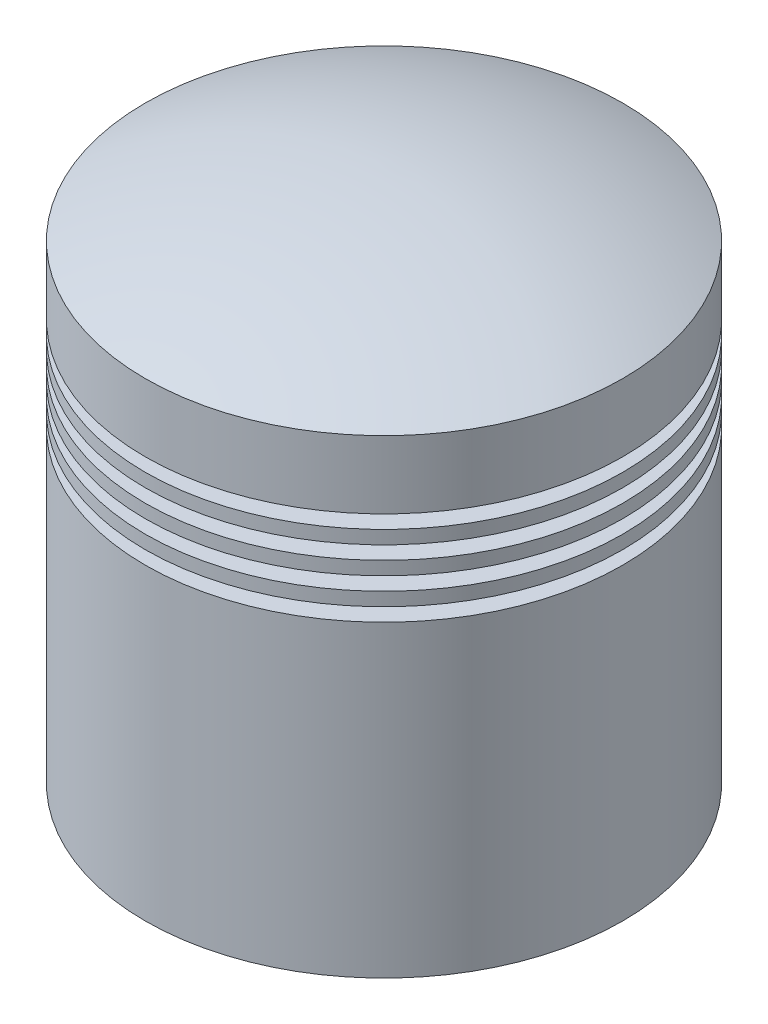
ISO-10303-21;
HEADER;
FILE_DESCRIPTION(('STEP AP214'),'2;1');
FILE_NAME('part.step','',(''),(''),'','','');
FILE_SCHEMA(('AUTOMOTIVE_DESIGN { 1 0 10303 214 1 1 1 1 }'));
ENDSEC;
DATA;
#1=APPLICATION_CONTEXT('core data for automotive mechanical design processes');
#2=APPLICATION_PROTOCOL_DEFINITION('international standard','automotive_design',2000,#1);
#3=PRODUCT_CONTEXT('',#1,'mechanical');
#4=PRODUCT('Part','Part','',(#3));
#5=PRODUCT_RELATED_PRODUCT_CATEGORY('part','',(#4));
#6=PRODUCT_DEFINITION_FORMATION('','',#4);
#7=PRODUCT_DEFINITION_CONTEXT('part definition',#1,'design');
#8=PRODUCT_DEFINITION('design','',#6,#7);
#9=PRODUCT_DEFINITION_SHAPE('','',#8);
#10=(LENGTH_UNIT() NAMED_UNIT(*) SI_UNIT(.MILLI.,.METRE.));
#11=(NAMED_UNIT(*) PLANE_ANGLE_UNIT() SI_UNIT($,.RADIAN.));
#12=(NAMED_UNIT(*) SI_UNIT($,.STERADIAN.) SOLID_ANGLE_UNIT());
#13=UNCERTAINTY_MEASURE_WITH_UNIT(LENGTH_MEASURE(1.E-05),#10,'distance_accuracy_value','');
#14=(GEOMETRIC_REPRESENTATION_CONTEXT(3) GLOBAL_UNCERTAINTY_ASSIGNED_CONTEXT((#13)) GLOBAL_UNIT_ASSIGNED_CONTEXT((#10,
#11,#12)) REPRESENTATION_CONTEXT('',''));
#15=CARTESIAN_POINT('',(0.,0.,0.));
#16=DIRECTION('',(0.,0.,1.));
#17=DIRECTION('',(1.,0.,0.));
#18=AXIS2_PLACEMENT_3D('',#15,#16,#17);
#19=CARTESIAN_POINT('',(44.5392513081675,72.2640545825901,0.));
#20=DIRECTION('',(0.,-1.,0.));
#21=DIRECTION('',(0.,0.,-1.));
#22=AXIS2_PLACEMENT_3D('',#19,#20,#21);
#23=PLANE('',#22);
#24=CARTESIAN_POINT('',(0.,72.2640545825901,0.));
#25=DIRECTION('',(0.,-1.,0.));
#26=DIRECTION('',(0.,0.,-1.));
#27=AXIS2_PLACEMENT_3D('',#24,#25,#26);
#28=CIRCLE('',#27,44.5392513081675);
#29=CARTESIAN_POINT('',(0.,72.2640545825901,-44.5392513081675));
#30=VERTEX_POINT('',#29);
#31=EDGE_CURVE('E10',#30,#30,#28,.T.);
#32=ORIENTED_EDGE('',*,*,#31,.T.);
#33=EDGE_LOOP('',(#32));
#34=FACE_BOUND('',#33,.T.);
#35=CARTESIAN_POINT('',(0.,72.2640545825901,0.));
#36=DIRECTION('',(0.,-1.,0.));
#37=DIRECTION('',(0.,0.,-1.));
#38=AXIS2_PLACEMENT_3D('',#35,#36,#37);
#39=CIRCLE('',#38,39.5392513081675);
#40=CARTESIAN_POINT('',(0.,72.2640545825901,-39.5392513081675));
#41=VERTEX_POINT('',#40);
#42=EDGE_CURVE('E100',#41,#41,#39,.T.);
#43=ORIENTED_EDGE('',*,*,#42,.F.);
#44=EDGE_LOOP('',(#43));
#45=FACE_BOUND('',#44,.T.);
#46=ADVANCED_FACE('F30',(#34,#45),#23,.T.);
#47=CARTESIAN_POINT('',(0.,0.,0.));
#48=DIRECTION('',(0.,-1.,0.));
#49=DIRECTION('',(0.,0.,-1.));
#50=AXIS2_PLACEMENT_3D('',#47,#48,#49);
#51=CYLINDRICAL_SURFACE('',#50,44.5392513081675);
#52=CARTESIAN_POINT('',(0.,74.7640545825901,0.));
#53=DIRECTION('',(0.,-1.,0.));
#54=DIRECTION('',(0.,0.,-1.));
#55=AXIS2_PLACEMENT_3D('',#52,#53,#54);
#56=CIRCLE('',#55,44.5392513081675);
#57=CARTESIAN_POINT('',(0.,74.7640545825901,-44.5392513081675));
#58=VERTEX_POINT('',#57);
#59=EDGE_CURVE('E36',#58,#58,#56,.T.);
#60=ORIENTED_EDGE('',*,*,#59,.T.);
#61=EDGE_LOOP('',(#60));
#62=FACE_BOUND('',#61,.T.);
#63=ORIENTED_EDGE('',*,*,#31,.F.);
#64=EDGE_LOOP('',(#63));
#65=FACE_BOUND('',#64,.T.);
#66=ADVANCED_FACE('F108',(#62,#65),#51,.T.);
#67=CARTESIAN_POINT('',(44.5392513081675,74.7640545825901,0.));
#68=DIRECTION('',(0.,1.,0.));
#69=DIRECTION('',(0.,0.,1.));
#70=AXIS2_PLACEMENT_3D('',#67,#68,#69);
#71=PLANE('',#70);
#72=CARTESIAN_POINT('',(0.,74.7640545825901,0.));
#73=DIRECTION('',(0.,-1.,0.));
#74=DIRECTION('',(0.,0.,-1.));
#75=AXIS2_PLACEMENT_3D('',#72,#73,#74);
#76=CIRCLE('',#75,39.5392513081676);
#77=CARTESIAN_POINT('',(0.,74.7640545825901,-39.5392513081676));
#78=VERTEX_POINT('',#77);
#79=EDGE_CURVE('E40',#78,#78,#76,.T.);
#80=ORIENTED_EDGE('',*,*,#79,.T.);
#81=EDGE_LOOP('',(#80));
#82=FACE_BOUND('',#81,.T.);
#83=ORIENTED_EDGE('',*,*,#59,.F.);
#84=EDGE_LOOP('',(#83));
#85=FACE_BOUND('',#84,.T.);
#86=ADVANCED_FACE('F112',(#82,#85),#71,.T.);
#87=CARTESIAN_POINT('',(0.,0.,0.));
#88=DIRECTION('',(0.,-1.,0.));
#89=DIRECTION('',(0.,0.,-1.));
#90=AXIS2_PLACEMENT_3D('',#87,#88,#89);
#91=CYLINDRICAL_SURFACE('',#90,39.5392513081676);
#92=CARTESIAN_POINT('',(0.,77.2640545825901,0.));
#93=DIRECTION('',(0.,-1.,0.));
#94=DIRECTION('',(0.,0.,-1.));
#95=AXIS2_PLACEMENT_3D('',#92,#93,#94);
#96=CIRCLE('',#95,39.5392513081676);
#97=CARTESIAN_POINT('',(0.,77.2640545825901,-39.5392513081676));
#98=VERTEX_POINT('',#97);
#99=EDGE_CURVE('E44',#98,#98,#96,.T.);
#100=ORIENTED_EDGE('',*,*,#99,.T.);
#101=EDGE_LOOP('',(#100));
#102=FACE_BOUND('',#101,.T.);
#103=ORIENTED_EDGE('',*,*,#79,.F.);
#104=EDGE_LOOP('',(#103));
#105=FACE_BOUND('',#104,.T.);
#106=ADVANCED_FACE('F116',(#102,#105),#91,.T.);
#107=CARTESIAN_POINT('',(39.5392513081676,77.2640545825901,0.));
#108=DIRECTION('',(0.,-1.,0.));
#109=DIRECTION('',(0.,0.,-1.));
#110=AXIS2_PLACEMENT_3D('',#107,#108,#109);
#111=PLANE('',#110);
#112=CARTESIAN_POINT('',(0.,77.2640545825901,0.));
#113=DIRECTION('',(0.,-1.,0.));
#114=DIRECTION('',(0.,0.,-1.));
#115=AXIS2_PLACEMENT_3D('',#112,#113,#114);
#116=CIRCLE('',#115,44.5392513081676);
#117=CARTESIAN_POINT('',(0.,77.2640545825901,-44.5392513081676));
#118=VERTEX_POINT('',#117);
#119=EDGE_CURVE('E49',#118,#118,#116,.T.);
#120=ORIENTED_EDGE('',*,*,#119,.T.);
#121=EDGE_LOOP('',(#120));
#122=FACE_BOUND('',#121,.T.);
#123=ORIENTED_EDGE('',*,*,#99,.F.);
#124=EDGE_LOOP('',(#123));
#125=FACE_BOUND('',#124,.T.);
#126=ADVANCED_FACE('F123',(#122,#125),#111,.T.);
#127=CARTESIAN_POINT('',(0.,0.,0.));
#128=DIRECTION('',(0.,-1.,0.));
#129=DIRECTION('',(0.,0.,-1.));
#130=AXIS2_PLACEMENT_3D('',#127,#128,#129);
#131=CYLINDRICAL_SURFACE('',#130,44.5392513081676);
#132=CARTESIAN_POINT('',(0.,89.9083363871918,0.));
#133=DIRECTION('',(0.,-1.,0.));
#134=DIRECTION('',(0.,0.,-1.));
#135=AXIS2_PLACEMENT_3D('',#132,#133,#134);
#136=CIRCLE('',#135,44.5392513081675);
#137=CARTESIAN_POINT('',(0.,89.9083363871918,-44.5392513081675));
#138=VERTEX_POINT('',#137);
#139=EDGE_CURVE('E52',#138,#138,#136,.T.);
#140=ORIENTED_EDGE('',*,*,#139,.T.);
#141=EDGE_LOOP('',(#140));
#142=FACE_BOUND('',#141,.T.);
#143=ORIENTED_EDGE('',*,*,#119,.F.);
#144=EDGE_LOOP('',(#143));
#145=FACE_BOUND('',#144,.T.);
#146=ADVANCED_FACE('F127',(#142,#145),#131,.T.);
#147=CARTESIAN_POINT('',(0.,-3.33214926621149,0.));
#148=DIRECTION('',(0.,-1.,0.));
#149=DIRECTION('',(1.,0.,0.));
#150=AXIS2_PLACEMENT_3D('',#147,#148,#149);
#151=SPHERICAL_SURFACE('',#150,103.332149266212);
#152=ORIENTED_EDGE('',*,*,#139,.F.);
#153=EDGE_LOOP('',(#152));
#154=FACE_BOUND('',#153,.T.);
#155=ADVANCED_FACE('F131',(#154),#151,.T.);
#156=CARTESIAN_POINT('',(34.5392513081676,89.9083363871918,0.));
#157=DIRECTION('',(0.,-1.,0.));
#158=DIRECTION('',(0.,0.,-1.));
#159=AXIS2_PLACEMENT_3D('',#156,#157,#158);
#160=PLANE('',#159);
#161=CARTESIAN_POINT('',(0.,89.9083363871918,0.));
#162=DIRECTION('',(0.,-1.,0.));
#163=DIRECTION('',(0.,0.,-1.));
#164=AXIS2_PLACEMENT_3D('',#161,#162,#163);
#165=CIRCLE('',#164,34.5392513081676);
#166=CARTESIAN_POINT('',(0.,89.9083363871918,-34.5392513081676));
#167=VERTEX_POINT('',#166);
#168=EDGE_CURVE('E55',#167,#167,#165,.T.);
#169=ORIENTED_EDGE('',*,*,#168,.T.);
#170=EDGE_LOOP('',(#169));
#171=FACE_BOUND('',#170,.T.);
#172=ADVANCED_FACE('F135',(#171),#160,.T.);
#173=CARTESIAN_POINT('',(0.,0.,0.));
#174=DIRECTION('',(0.,-1.,0.));
#175=DIRECTION('',(0.,0.,-1.));
#176=AXIS2_PLACEMENT_3D('',#173,#174,#175);
#177=CYLINDRICAL_SURFACE('',#176,34.5392513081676);
#178=CARTESIAN_POINT('',(0.,47.26405458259,0.));
#179=DIRECTION('',(0.,-1.,0.));
#180=DIRECTION('',(0.,0.,-1.));
#181=AXIS2_PLACEMENT_3D('',#178,#179,#180);
#182=CIRCLE('',#181,34.5392513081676);
#183=CARTESIAN_POINT('',(0.,47.26405458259,-34.5392513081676));
#184=VERTEX_POINT('',#183);
#185=EDGE_CURVE('E58',#184,#184,#182,.T.);
#186=ORIENTED_EDGE('',*,*,#185,.T.);
#187=EDGE_LOOP('',(#186));
#188=FACE_BOUND('',#187,.T.);
#189=ORIENTED_EDGE('',*,*,#168,.F.);
#190=EDGE_LOOP('',(#189));
#191=FACE_BOUND('',#190,.T.);
#192=ADVANCED_FACE('F139',(#188,#191),#177,.F.);
#193=CARTESIAN_POINT('',(39.5392513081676,47.26405458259,0.));
#194=DIRECTION('',(0.,-1.,0.));
#195=DIRECTION('',(0.,0.,-1.));
#196=AXIS2_PLACEMENT_3D('',#193,#194,#195);
#197=PLANE('',#196);
#198=CARTESIAN_POINT('',(0.,47.26405458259,0.));
#199=DIRECTION('',(0.,-1.,0.));
#200=DIRECTION('',(0.,0.,-1.));
#201=AXIS2_PLACEMENT_3D('',#198,#199,#200);
#202=CIRCLE('',#201,39.5392513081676);
#203=CARTESIAN_POINT('',(0.,47.26405458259,-39.5392513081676));
#204=VERTEX_POINT('',#203);
#205=EDGE_CURVE('E61',#204,#204,#202,.T.);
#206=ORIENTED_EDGE('',*,*,#205,.T.);
#207=EDGE_LOOP('',(#206));
#208=FACE_BOUND('',#207,.T.);
#209=ORIENTED_EDGE('',*,*,#185,.F.);
#210=EDGE_LOOP('',(#209));
#211=FACE_BOUND('',#210,.T.);
#212=ADVANCED_FACE('F143',(#208,#211),#197,.T.);
#213=CARTESIAN_POINT('',(0.,0.,0.));
#214=DIRECTION('',(0.,-1.,0.));
#215=DIRECTION('',(0.,0.,-1.));
#216=AXIS2_PLACEMENT_3D('',#213,#214,#215);
#217=CYLINDRICAL_SURFACE('',#216,39.5392513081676);
#218=CARTESIAN_POINT('',(0.,2.26405458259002,0.));
#219=DIRECTION('',(0.,-1.,0.));
#220=DIRECTION('',(0.,0.,-1.));
#221=AXIS2_PLACEMENT_3D('',#218,#219,#220);
#222=CIRCLE('',#221,39.5392513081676);
#223=CARTESIAN_POINT('',(0.,2.26405458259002,-39.5392513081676));
#224=VERTEX_POINT('',#223);
#225=EDGE_CURVE('E64',#224,#224,#222,.T.);
#226=ORIENTED_EDGE('',*,*,#225,.T.);
#227=EDGE_LOOP('',(#226));
#228=FACE_BOUND('',#227,.T.);
#229=ORIENTED_EDGE('',*,*,#205,.F.);
#230=EDGE_LOOP('',(#229));
#231=FACE_BOUND('',#230,.T.);
#232=ADVANCED_FACE('F147',(#228,#231),#217,.F.);
#233=CARTESIAN_POINT('',(44.5392513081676,2.26405458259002,0.));
#234=DIRECTION('',(0.,-1.,0.));
#235=DIRECTION('',(0.,0.,-1.));
#236=AXIS2_PLACEMENT_3D('',#233,#234,#235);
#237=PLANE('',#236);
#238=CARTESIAN_POINT('',(0.,2.26405458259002,0.));
#239=DIRECTION('',(0.,-1.,0.));
#240=DIRECTION('',(0.,0.,-1.));
#241=AXIS2_PLACEMENT_3D('',#238,#239,#240);
#242=CIRCLE('',#241,44.5392513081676);
#243=CARTESIAN_POINT('',(0.,2.26405458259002,-44.5392513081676));
#244=VERTEX_POINT('',#243);
#245=EDGE_CURVE('E67',#244,#244,#242,.T.);
#246=ORIENTED_EDGE('',*,*,#245,.T.);
#247=EDGE_LOOP('',(#246));
#248=FACE_BOUND('',#247,.T.);
#249=ORIENTED_EDGE('',*,*,#225,.F.);
#250=EDGE_LOOP('',(#249));
#251=FACE_BOUND('',#250,.T.);
#252=ADVANCED_FACE('F151',(#248,#251),#237,.T.);
#253=CARTESIAN_POINT('',(0.,0.,0.));
#254=DIRECTION('',(0.,-1.,0.));
#255=DIRECTION('',(0.,0.,-1.));
#256=AXIS2_PLACEMENT_3D('',#253,#254,#255);
#257=CYLINDRICAL_SURFACE('',#256,44.5392513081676);
#258=CARTESIAN_POINT('',(0.,59.7640545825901,0.));
#259=DIRECTION('',(0.,-1.,0.));
#260=DIRECTION('',(0.,0.,-1.));
#261=AXIS2_PLACEMENT_3D('',#258,#259,#260);
#262=CIRCLE('',#261,44.5392513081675);
#263=CARTESIAN_POINT('',(0.,59.7640545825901,-44.5392513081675));
#264=VERTEX_POINT('',#263);
#265=EDGE_CURVE('E70',#264,#264,#262,.T.);
#266=ORIENTED_EDGE('',*,*,#265,.T.);
#267=EDGE_LOOP('',(#266));
#268=FACE_BOUND('',#267,.T.);
#269=ORIENTED_EDGE('',*,*,#245,.F.);
#270=EDGE_LOOP('',(#269));
#271=FACE_BOUND('',#270,.T.);
#272=ADVANCED_FACE('F155',(#268,#271),#257,.T.);
#273=CARTESIAN_POINT('',(39.5392513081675,59.7640545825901,0.));
#274=DIRECTION('',(0.,1.,0.));
#275=DIRECTION('',(0.,0.,1.));
#276=AXIS2_PLACEMENT_3D('',#273,#274,#275);
#277=PLANE('',#276);
#278=CARTESIAN_POINT('',(0.,59.7640545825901,0.));
#279=DIRECTION('',(0.,-1.,0.));
#280=DIRECTION('',(0.,0.,-1.));
#281=AXIS2_PLACEMENT_3D('',#278,#279,#280);
#282=CIRCLE('',#281,39.5392513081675);
#283=CARTESIAN_POINT('',(0.,59.7640545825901,-39.5392513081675));
#284=VERTEX_POINT('',#283);
#285=EDGE_CURVE('E73',#284,#284,#282,.T.);
#286=ORIENTED_EDGE('',*,*,#285,.T.);
#287=EDGE_LOOP('',(#286));
#288=FACE_BOUND('',#287,.T.);
#289=ORIENTED_EDGE('',*,*,#265,.F.);
#290=EDGE_LOOP('',(#289));
#291=FACE_BOUND('',#290,.T.);
#292=ADVANCED_FACE('F159',(#288,#291),#277,.T.);
#293=CARTESIAN_POINT('',(0.,0.,0.));
#294=DIRECTION('',(0.,-1.,0.));
#295=DIRECTION('',(0.,0.,-1.));
#296=AXIS2_PLACEMENT_3D('',#293,#294,#295);
#297=CYLINDRICAL_SURFACE('',#296,39.5392513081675);
#298=CARTESIAN_POINT('',(0.,62.2640545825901,0.));
#299=DIRECTION('',(0.,-1.,0.));
#300=DIRECTION('',(0.,0.,-1.));
#301=AXIS2_PLACEMENT_3D('',#298,#299,#300);
#302=CIRCLE('',#301,39.5392513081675);
#303=CARTESIAN_POINT('',(0.,62.2640545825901,-39.5392513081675));
#304=VERTEX_POINT('',#303);
#305=EDGE_CURVE('E76',#304,#304,#302,.T.);
#306=ORIENTED_EDGE('',*,*,#305,.T.);
#307=EDGE_LOOP('',(#306));
#308=FACE_BOUND('',#307,.T.);
#309=ORIENTED_EDGE('',*,*,#285,.F.);
#310=EDGE_LOOP('',(#309));
#311=FACE_BOUND('',#310,.T.);
#312=ADVANCED_FACE('F163',(#308,#311),#297,.T.);
#313=CARTESIAN_POINT('',(44.5392513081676,62.2640545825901,0.));
#314=DIRECTION('',(0.,-1.,0.));
#315=DIRECTION('',(0.,0.,-1.));
#316=AXIS2_PLACEMENT_3D('',#313,#314,#315);
#317=PLANE('',#316);
#318=CARTESIAN_POINT('',(0.,62.2640545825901,0.));
#319=DIRECTION('',(0.,-1.,0.));
#320=DIRECTION('',(0.,0.,-1.));
#321=AXIS2_PLACEMENT_3D('',#318,#319,#320);
#322=CIRCLE('',#321,44.5392513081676);
#323=CARTESIAN_POINT('',(0.,62.2640545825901,-44.5392513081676));
#324=VERTEX_POINT('',#323);
#325=EDGE_CURVE('E79',#324,#324,#322,.T.);
#326=ORIENTED_EDGE('',*,*,#325,.T.);
#327=EDGE_LOOP('',(#326));
#328=FACE_BOUND('',#327,.T.);
#329=ORIENTED_EDGE('',*,*,#305,.F.);
#330=EDGE_LOOP('',(#329));
#331=FACE_BOUND('',#330,.T.);
#332=ADVANCED_FACE('F167',(#328,#331),#317,.T.);
#333=CARTESIAN_POINT('',(0.,0.,0.));
#334=DIRECTION('',(0.,-1.,0.));
#335=DIRECTION('',(0.,0.,-1.));
#336=AXIS2_PLACEMENT_3D('',#333,#334,#335);
#337=CYLINDRICAL_SURFACE('',#336,44.5392513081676);
#338=CARTESIAN_POINT('',(0.,64.7640545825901,0.));
#339=DIRECTION('',(0.,-1.,0.));
#340=DIRECTION('',(0.,0.,-1.));
#341=AXIS2_PLACEMENT_3D('',#338,#339,#340);
#342=CIRCLE('',#341,44.5392513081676);
#343=CARTESIAN_POINT('',(0.,64.7640545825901,-44.5392513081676));
#344=VERTEX_POINT('',#343);
#345=EDGE_CURVE('E82',#344,#344,#342,.T.);
#346=ORIENTED_EDGE('',*,*,#345,.T.);
#347=EDGE_LOOP('',(#346));
#348=FACE_BOUND('',#347,.T.);
#349=ORIENTED_EDGE('',*,*,#325,.F.);
#350=EDGE_LOOP('',(#349));
#351=FACE_BOUND('',#350,.T.);
#352=ADVANCED_FACE('F171',(#348,#351),#337,.T.);
#353=CARTESIAN_POINT('',(39.5392513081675,64.7640545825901,0.));
#354=DIRECTION('',(0.,1.,0.));
#355=DIRECTION('',(0.,0.,1.));
#356=AXIS2_PLACEMENT_3D('',#353,#354,#355);
#357=PLANE('',#356);
#358=CARTESIAN_POINT('',(0.,64.7640545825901,0.));
#359=DIRECTION('',(0.,-1.,0.));
#360=DIRECTION('',(0.,0.,-1.));
#361=AXIS2_PLACEMENT_3D('',#358,#359,#360);
#362=CIRCLE('',#361,39.5392513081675);
#363=CARTESIAN_POINT('',(0.,64.7640545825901,-39.5392513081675));
#364=VERTEX_POINT('',#363);
#365=EDGE_CURVE('E85',#364,#364,#362,.T.);
#366=ORIENTED_EDGE('',*,*,#365,.T.);
#367=EDGE_LOOP('',(#366));
#368=FACE_BOUND('',#367,.T.);
#369=ORIENTED_EDGE('',*,*,#345,.F.);
#370=EDGE_LOOP('',(#369));
#371=FACE_BOUND('',#370,.T.);
#372=ADVANCED_FACE('F175',(#368,#371),#357,.T.);
#373=CARTESIAN_POINT('',(0.,0.,0.));
#374=DIRECTION('',(0.,-1.,0.));
#375=DIRECTION('',(0.,0.,-1.));
#376=AXIS2_PLACEMENT_3D('',#373,#374,#375);
#377=CYLINDRICAL_SURFACE('',#376,39.5392513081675);
#378=CARTESIAN_POINT('',(0.,67.2640545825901,0.));
#379=DIRECTION('',(0.,-1.,0.));
#380=DIRECTION('',(0.,0.,-1.));
#381=AXIS2_PLACEMENT_3D('',#378,#379,#380);
#382=CIRCLE('',#381,39.5392513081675);
#383=CARTESIAN_POINT('',(0.,67.2640545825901,-39.5392513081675));
#384=VERTEX_POINT('',#383);
#385=EDGE_CURVE('E88',#384,#384,#382,.T.);
#386=ORIENTED_EDGE('',*,*,#385,.T.);
#387=EDGE_LOOP('',(#386));
#388=FACE_BOUND('',#387,.T.);
#389=ORIENTED_EDGE('',*,*,#365,.F.);
#390=EDGE_LOOP('',(#389));
#391=FACE_BOUND('',#390,.T.);
#392=ADVANCED_FACE('F179',(#388,#391),#377,.T.);
#393=CARTESIAN_POINT('',(44.5392513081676,67.2640545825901,0.));
#394=DIRECTION('',(0.,-1.,0.));
#395=DIRECTION('',(0.,0.,-1.));
#396=AXIS2_PLACEMENT_3D('',#393,#394,#395);
#397=PLANE('',#396);
#398=CARTESIAN_POINT('',(0.,67.2640545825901,0.));
#399=DIRECTION('',(0.,-1.,0.));
#400=DIRECTION('',(0.,0.,-1.));
#401=AXIS2_PLACEMENT_3D('',#398,#399,#400);
#402=CIRCLE('',#401,44.5392513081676);
#403=CARTESIAN_POINT('',(0.,67.2640545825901,-44.5392513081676));
#404=VERTEX_POINT('',#403);
#405=EDGE_CURVE('E91',#404,#404,#402,.T.);
#406=ORIENTED_EDGE('',*,*,#405,.T.);
#407=EDGE_LOOP('',(#406));
#408=FACE_BOUND('',#407,.T.);
#409=ORIENTED_EDGE('',*,*,#385,.F.);
#410=EDGE_LOOP('',(#409));
#411=FACE_BOUND('',#410,.T.);
#412=ADVANCED_FACE('F183',(#408,#411),#397,.T.);
#413=CARTESIAN_POINT('',(0.,0.,0.));
#414=DIRECTION('',(0.,-1.,0.));
#415=DIRECTION('',(0.,0.,-1.));
#416=AXIS2_PLACEMENT_3D('',#413,#414,#415);
#417=CYLINDRICAL_SURFACE('',#416,44.5392513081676);
#418=CARTESIAN_POINT('',(0.,69.7640545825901,0.));
#419=DIRECTION('',(0.,-1.,0.));
#420=DIRECTION('',(0.,0.,-1.));
#421=AXIS2_PLACEMENT_3D('',#418,#419,#420);
#422=CIRCLE('',#421,44.5392513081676);
#423=CARTESIAN_POINT('',(0.,69.7640545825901,-44.5392513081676));
#424=VERTEX_POINT('',#423);
#425=EDGE_CURVE('E94',#424,#424,#422,.T.);
#426=ORIENTED_EDGE('',*,*,#425,.T.);
#427=EDGE_LOOP('',(#426));
#428=FACE_BOUND('',#427,.T.);
#429=ORIENTED_EDGE('',*,*,#405,.F.);
#430=EDGE_LOOP('',(#429));
#431=FACE_BOUND('',#430,.T.);
#432=ADVANCED_FACE('F187',(#428,#431),#417,.T.);
#433=CARTESIAN_POINT('',(39.5392513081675,69.7640545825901,0.));
#434=DIRECTION('',(0.,1.,0.));
#435=DIRECTION('',(0.,0.,1.));
#436=AXIS2_PLACEMENT_3D('',#433,#434,#435);
#437=PLANE('',#436);
#438=CARTESIAN_POINT('',(0.,69.7640545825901,0.));
#439=DIRECTION('',(0.,-1.,0.));
#440=DIRECTION('',(0.,0.,-1.));
#441=AXIS2_PLACEMENT_3D('',#438,#439,#440);
#442=CIRCLE('',#441,39.5392513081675);
#443=CARTESIAN_POINT('',(0.,69.7640545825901,-39.5392513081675));
#444=VERTEX_POINT('',#443);
#445=EDGE_CURVE('E97',#444,#444,#442,.T.);
#446=ORIENTED_EDGE('',*,*,#445,.T.);
#447=EDGE_LOOP('',(#446));
#448=FACE_BOUND('',#447,.T.);
#449=ORIENTED_EDGE('',*,*,#425,.F.);
#450=EDGE_LOOP('',(#449));
#451=FACE_BOUND('',#450,.T.);
#452=ADVANCED_FACE('F191',(#448,#451),#437,.T.);
#453=CARTESIAN_POINT('',(0.,0.,0.));
#454=DIRECTION('',(0.,-1.,0.));
#455=DIRECTION('',(0.,0.,-1.));
#456=AXIS2_PLACEMENT_3D('',#453,#454,#455);
#457=CYLINDRICAL_SURFACE('',#456,39.5392513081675);
#458=ORIENTED_EDGE('',*,*,#42,.T.);
#459=EDGE_LOOP('',(#458));
#460=FACE_BOUND('',#459,.T.);
#461=ORIENTED_EDGE('',*,*,#445,.F.);
#462=EDGE_LOOP('',(#461));
#463=FACE_BOUND('',#462,.T.);
#464=ADVANCED_FACE('F104',(#460,#463),#457,.T.);
#465=CLOSED_SHELL('',(#46,#66,#86,#106,#126,#146,#155,#172,#192,#212,#232,#252,#272,#292,#312,
#332,#352,#372,#392,#412,#432,#452,#464));
#466=MANIFOLD_SOLID_BREP('B2',#465);
#467=ADVANCED_BREP_SHAPE_REPRESENTATION('',(#18,#466),#14);
#468=SHAPE_DEFINITION_REPRESENTATION(#9,#467);
ENDSEC;
END-ISO-10303-21;
